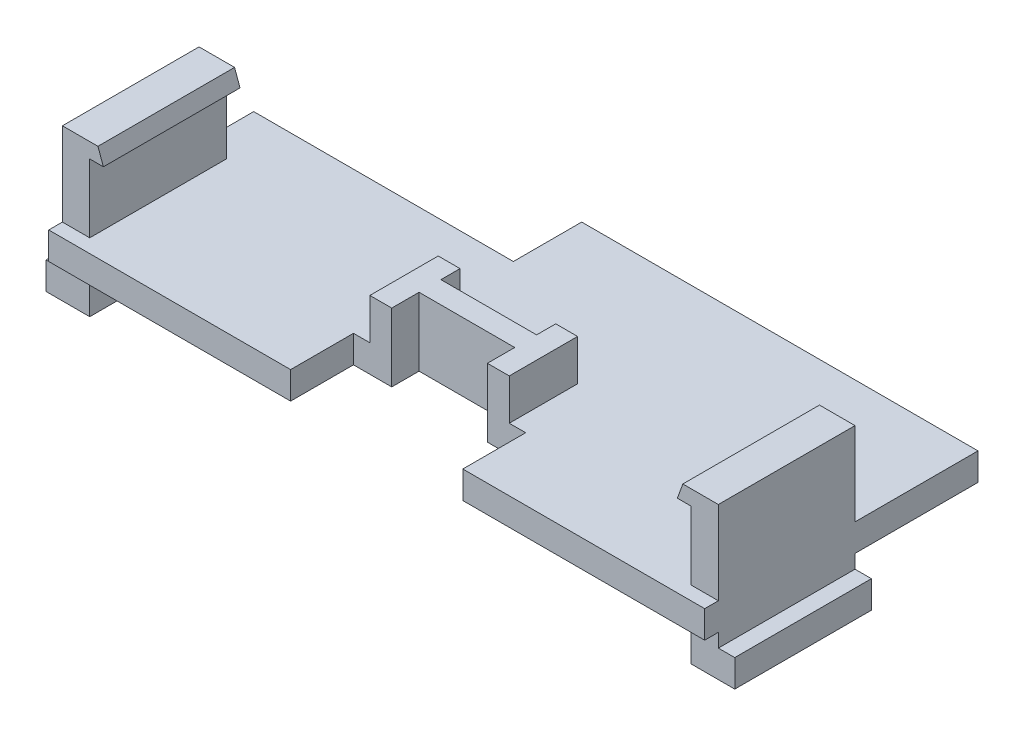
from build123d import *

# Parameters (mm, degrees)
SKETCH1_W                = 24
SKETCH1_H                = 10
BOSS_EXTRUDE1_DEPTH      = 1
CUT_EXTRUDE1_REACH       = 17.033
SKETCH2_W                = 9.5
SKETCH2_H                = 2.5
BOSS_EXTRUDE2_DEPTH      = 1.5
BOSS_EXTRUDE3_DEPTH      = 0.5
BOSS_EXTRUDE3_DEPTH_BACK = 4.5


with BuildPart() as part:
    # Sketch1 → Boss-Extrude1 (new body)
    with BuildSketch(Plane(origin=(0, 0, 0), x_dir=(1, 0, 0), z_dir=(0, 1, 0))):
        with Locations((0, 4)):
            Rectangle(SKETCH1_W, SKETCH1_H)
    extrude(amount=BOSS_EXTRUDE1_DEPTH)

    # Sketch2 → Cut-Extrude1 (cut, up to next)
    with BuildSketch(Plane(origin=(0, 1, 0), x_dir=(1, 0, 0), z_dir=(0, 1, 0)), mode=Mode.PRIVATE) as cut_extrude1_sk1:
        Polygon((-3.15, -1), (-3.15, 1.3), (-1.75, 1.3), (-1.75, 2.3), (1.75, 2.3), (1.75, 1.3), (3.15, 1.3), (3.15, -1), align=None)
    cut_extrude1_tool1 = extrude(cut_extrude1_sk1.sketch, amount=-CUT_EXTRUDE1_REACH, mode=Mode.PRIVATE) & part.part
    # Sketch2 → Cut-Extrude1 (cut, up to next)
    with BuildSketch(Plane(origin=(0, 1, 0), x_dir=(1, 0, 0), z_dir=(0, 1, 0)), mode=Mode.PRIVATE) as cut_extrude1_sk2:
        with Locations((-7.25, 7.75)):
            Rectangle(SKETCH2_W, SKETCH2_H)
    cut_extrude1_tool2 = extrude(cut_extrude1_sk2.sketch, amount=-CUT_EXTRUDE1_REACH, mode=Mode.PRIVATE) & part.part
    add(cut_extrude1_tool1.solids().sort_by_distance((0, 1, -0.471012))[0], mode=Mode.SUBTRACT)
    add(cut_extrude1_tool2.solids().sort_by_distance((-7.25, 1, -7.75))[0], mode=Mode.SUBTRACT)

    # Sketch3 → Boss-Extrude2 (add)
    with BuildSketch(Plane(origin=(0, 1, 0), x_dir=(1, 0, 0), z_dir=(0, 1, 0))):
        Polygon((-2.55, 3.8), (-2.55, 1.3), (-1.75, 1.3), (-1.75, 2.3), (1.75, 2.3), (1.75, 1.3), (2.55, 1.3), (2.55, 3.8), (1.75, 3.8), (1.75, 3.1), (-1.75, 3.1), (-1.75, 3.8), align=None)
    extrude(amount=BOSS_EXTRUDE2_DEPTH)

    # Sketch4 → Boss-Extrude3 (add, two sides: drawn at the far end of the back side and taken through both)
    with BuildSketch(Plane.XY.offset(-BOSS_EXTRUDE3_DEPTH_BACK)):
        Polygon((12, 1), (12, 4.050680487), (10.7, 4.050680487), (10.5, 3.5), (11, 3.5), (11, 1), align=None)
        Polygon((12, 0), (12, -0.5), (12.6, -0.5), (12.6, -1.5), (11, -1.5), (11, 0), align=None)
        Polygon((-11, 0), (-12, 0), (-12, -0.5), (-12.6, -0.5), (-12.6, -1.5), (-11, -1.5), align=None)
        Polygon((-11, 1), (-12, 1), (-12, 4.050680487), (-10.7, 4.050680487), (-10.5, 3.5), (-11, 3.5), align=None)
    extrude(amount=BOSS_EXTRUDE3_DEPTH + BOSS_EXTRUDE3_DEPTH_BACK)


solid = part.part
